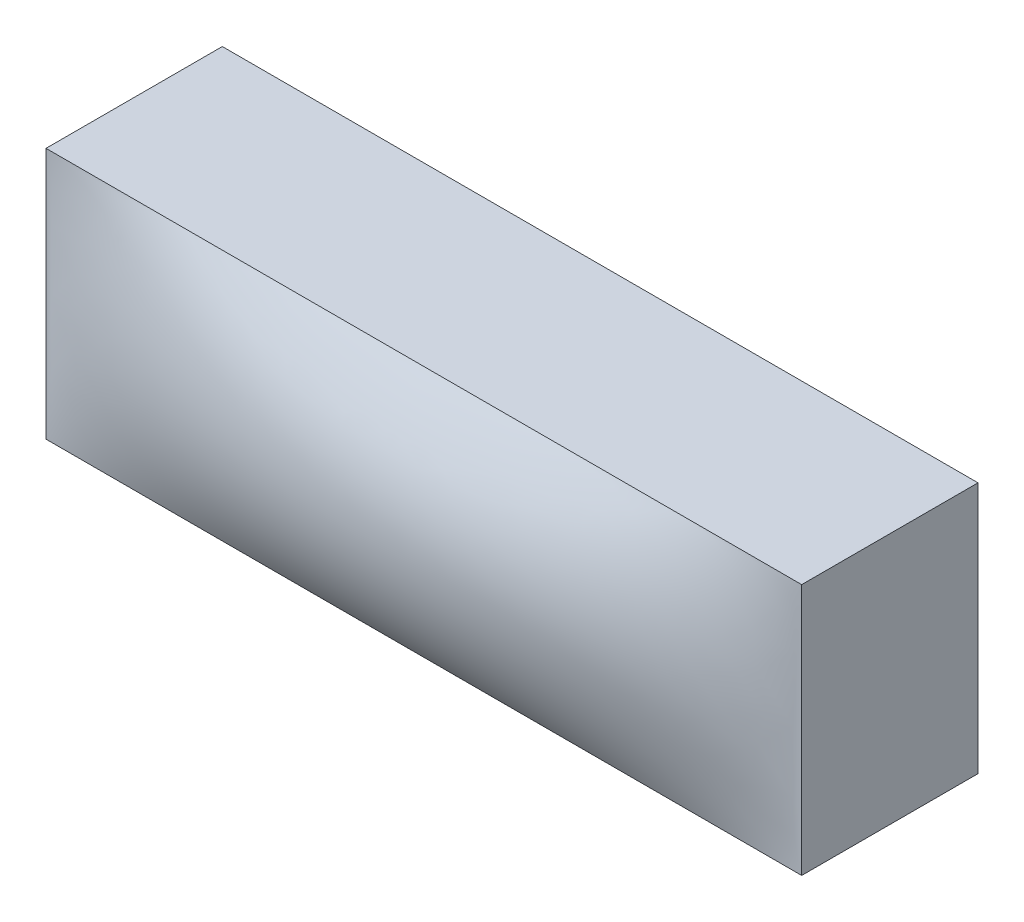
ISO-10303-21;
HEADER;
FILE_DESCRIPTION(('STEP AP214'),'2;1');
FILE_NAME('part.step','',(''),(''),'','','');
FILE_SCHEMA(('AUTOMOTIVE_DESIGN { 1 0 10303 214 1 1 1 1 }'));
ENDSEC;
DATA;
#1=APPLICATION_CONTEXT('core data for automotive mechanical design processes');
#2=APPLICATION_PROTOCOL_DEFINITION('international standard','automotive_design',2000,#1);
#3=PRODUCT_CONTEXT('',#1,'mechanical');
#4=PRODUCT('Part','Part','',(#3));
#5=PRODUCT_RELATED_PRODUCT_CATEGORY('part','',(#4));
#6=PRODUCT_DEFINITION_FORMATION('','',#4);
#7=PRODUCT_DEFINITION_CONTEXT('part definition',#1,'design');
#8=PRODUCT_DEFINITION('design','',#6,#7);
#9=PRODUCT_DEFINITION_SHAPE('','',#8);
#10=(LENGTH_UNIT() NAMED_UNIT(*) SI_UNIT(.MILLI.,.METRE.));
#11=(NAMED_UNIT(*) PLANE_ANGLE_UNIT() SI_UNIT($,.RADIAN.));
#12=(NAMED_UNIT(*) SI_UNIT($,.STERADIAN.) SOLID_ANGLE_UNIT());
#13=UNCERTAINTY_MEASURE_WITH_UNIT(LENGTH_MEASURE(1.E-05),#10,'distance_accuracy_value','');
#14=(GEOMETRIC_REPRESENTATION_CONTEXT(3) GLOBAL_UNCERTAINTY_ASSIGNED_CONTEXT((#13)) GLOBAL_UNIT_ASSIGNED_CONTEXT((#10,
#11,#12)) REPRESENTATION_CONTEXT('',''));
#15=CARTESIAN_POINT('',(0.,0.,0.));
#16=DIRECTION('',(0.,0.,1.));
#17=DIRECTION('',(1.,0.,0.));
#18=AXIS2_PLACEMENT_3D('',#15,#16,#17);
#19=CARTESIAN_POINT('',(0.,0.,7.));
#20=DIRECTION('',(1.,0.,0.));
#21=DIRECTION('',(0.,0.,-1.));
#22=AXIS2_PLACEMENT_3D('',#19,#20,#21);
#23=PLANE('',#22);
#24=DIRECTION('',(0.,-1.,0.));
#25=VECTOR('',#24,1.);
#26=CARTESIAN_POINT('',(0.,0.,0.));
#27=LINE('',#26,#25);
#28=CARTESIAN_POINT('',(0.,10.,0.));
#29=VERTEX_POINT('',#28);
#30=CARTESIAN_POINT('',(0.,0.,0.));
#31=VERTEX_POINT('',#30);
#32=EDGE_CURVE('E87',#29,#31,#27,.T.);
#33=ORIENTED_EDGE('',*,*,#32,.T.);
#34=DIRECTION('',(0.,0.,-1.));
#35=VECTOR('',#34,1.);
#36=CARTESIAN_POINT('',(0.,0.,7.));
#37=LINE('',#36,#35);
#38=CARTESIAN_POINT('',(0.,0.,7.));
#39=VERTEX_POINT('',#38);
#40=EDGE_CURVE('E11',#39,#31,#37,.T.);
#41=ORIENTED_EDGE('',*,*,#40,.F.);
#42=DIRECTION('',(0.,-1.,0.));
#43=VECTOR('',#42,1.);
#44=CARTESIAN_POINT('',(0.,0.,7.));
#45=LINE('',#44,#43);
#46=CARTESIAN_POINT('',(0.,10.,7.));
#47=VERTEX_POINT('',#46);
#48=EDGE_CURVE('E98',#47,#39,#45,.T.);
#49=ORIENTED_EDGE('',*,*,#48,.F.);
#50=DIRECTION('',(0.,0.,-1.));
#51=VECTOR('',#50,1.);
#52=CARTESIAN_POINT('',(0.,10.,7.));
#53=LINE('',#52,#51);
#54=EDGE_CURVE('E93',#47,#29,#53,.T.);
#55=ORIENTED_EDGE('',*,*,#54,.T.);
#56=EDGE_LOOP('',(#33,#41,#49,#55));
#57=FACE_BOUND('',#56,.T.);
#58=ADVANCED_FACE('F31',(#57),#23,.F.);
#59=CARTESIAN_POINT('',(0.,0.,7.));
#60=DIRECTION('',(0.,1.,0.));
#61=DIRECTION('',(0.,0.,1.));
#62=AXIS2_PLACEMENT_3D('',#59,#60,#61);
#63=PLANE('',#62);
#64=DIRECTION('',(1.,0.,0.));
#65=VECTOR('',#64,1.);
#66=CARTESIAN_POINT('',(0.,0.,0.));
#67=LINE('',#66,#65);
#68=CARTESIAN_POINT('',(30.,0.,0.));
#69=VERTEX_POINT('',#68);
#70=EDGE_CURVE('E84',#31,#69,#67,.T.);
#71=ORIENTED_EDGE('',*,*,#70,.T.);
#72=DIRECTION('',(0.,0.,-1.));
#73=VECTOR('',#72,1.);
#74=CARTESIAN_POINT('',(30.,0.,7.));
#75=LINE('',#74,#73);
#76=CARTESIAN_POINT('',(30.,0.,7.));
#77=VERTEX_POINT('',#76);
#78=EDGE_CURVE('E43',#77,#69,#75,.T.);
#79=ORIENTED_EDGE('',*,*,#78,.F.);
#80=DIRECTION('',(1.,0.,0.));
#81=VECTOR('',#80,1.);
#82=CARTESIAN_POINT('',(0.,0.,7.));
#83=LINE('',#82,#81);
#84=EDGE_CURVE('E37',#39,#77,#83,.T.);
#85=ORIENTED_EDGE('',*,*,#84,.F.);
#86=ORIENTED_EDGE('',*,*,#40,.T.);
#87=EDGE_LOOP('',(#71,#79,#85,#86));
#88=FACE_BOUND('',#87,.T.);
#89=ADVANCED_FACE('F90',(#88),#63,.F.);
#90=CARTESIAN_POINT('',(30.,0.,7.));
#91=DIRECTION('',(-1.,0.,0.));
#92=DIRECTION('',(0.,0.,1.));
#93=AXIS2_PLACEMENT_3D('',#90,#91,#92);
#94=PLANE('',#93);
#95=DIRECTION('',(0.,1.,0.));
#96=VECTOR('',#95,1.);
#97=CARTESIAN_POINT('',(30.,0.,0.));
#98=LINE('',#97,#96);
#99=CARTESIAN_POINT('',(30.,10.,0.));
#100=VERTEX_POINT('',#99);
#101=EDGE_CURVE('E76',#69,#100,#98,.T.);
#102=ORIENTED_EDGE('',*,*,#101,.T.);
#103=DIRECTION('',(0.,0.,-1.));
#104=VECTOR('',#103,1.);
#105=CARTESIAN_POINT('',(30.,10.,7.));
#106=LINE('',#105,#104);
#107=CARTESIAN_POINT('',(30.,10.,7.));
#108=VERTEX_POINT('',#107);
#109=EDGE_CURVE('E100',#108,#100,#106,.T.);
#110=ORIENTED_EDGE('',*,*,#109,.F.);
#111=DIRECTION('',(0.,1.,0.));
#112=VECTOR('',#111,1.);
#113=CARTESIAN_POINT('',(30.,0.,7.));
#114=LINE('',#113,#112);
#115=EDGE_CURVE('E104',#77,#108,#114,.T.);
#116=ORIENTED_EDGE('',*,*,#115,.F.);
#117=ORIENTED_EDGE('',*,*,#78,.T.);
#118=EDGE_LOOP('',(#102,#110,#116,#117));
#119=FACE_BOUND('',#118,.T.);
#120=ADVANCED_FACE('F106',(#119),#94,.F.);
#121=CARTESIAN_POINT('',(0.,10.,7.));
#122=DIRECTION('',(0.,-1.,0.));
#123=DIRECTION('',(0.,0.,-1.));
#124=AXIS2_PLACEMENT_3D('',#121,#122,#123);
#125=PLANE('',#124);
#126=DIRECTION('',(-1.,0.,0.));
#127=VECTOR('',#126,1.);
#128=CARTESIAN_POINT('',(0.,10.,0.));
#129=LINE('',#128,#127);
#130=EDGE_CURVE('E68',#100,#29,#129,.T.);
#131=ORIENTED_EDGE('',*,*,#130,.T.);
#132=ORIENTED_EDGE('',*,*,#54,.F.);
#133=DIRECTION('',(-1.,0.,0.));
#134=VECTOR('',#133,1.);
#135=CARTESIAN_POINT('',(0.,10.,7.));
#136=LINE('',#135,#134);
#137=EDGE_CURVE('E52',#108,#47,#136,.T.);
#138=ORIENTED_EDGE('',*,*,#137,.F.);
#139=ORIENTED_EDGE('',*,*,#109,.T.);
#140=EDGE_LOOP('',(#131,#132,#138,#139));
#141=FACE_BOUND('',#140,.T.);
#142=ADVANCED_FACE('F107',(#141),#125,.F.);
#143=CARTESIAN_POINT('',(0.,0.,7.));
#144=CARTESIAN_POINT('',(10.,0.,7.));
#145=CARTESIAN_POINT('',(20.,0.,7.));
#146=CARTESIAN_POINT('',(30.,0.,7.));
#147=CARTESIAN_POINT('',(0.,3.33333333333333,7.));
#148=CARTESIAN_POINT('',(10.,3.33333333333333,10.5555555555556));
#149=CARTESIAN_POINT('',(20.,3.33333333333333,10.5555555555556));
#150=CARTESIAN_POINT('',(30.,3.33333333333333,7.));
#151=CARTESIAN_POINT('',(0.,6.66666666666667,7.));
#152=CARTESIAN_POINT('',(10.,6.66666666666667,10.5555555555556));
#153=CARTESIAN_POINT('',(20.,6.66666666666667,10.5555555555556));
#154=CARTESIAN_POINT('',(30.,6.66666666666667,7.));
#155=CARTESIAN_POINT('',(0.,10.,7.));
#156=CARTESIAN_POINT('',(10.,10.,7.));
#157=CARTESIAN_POINT('',(20.,10.,7.));
#158=CARTESIAN_POINT('',(30.,10.,7.));
#159=B_SPLINE_SURFACE_WITH_KNOTS('',3,3,((#143,#144,#145,#146),(#147,#148,#149,#150),(#151,#152,
#153,#154),(#155,#156,#157,#158)),.UNSPECIFIED.,.F.,.F.,.F.,(4,4),(4,4),(0.,1.),(0.,1.),.UNSPECIFIED.);
#160=ORIENTED_EDGE('',*,*,#48,.T.);
#161=ORIENTED_EDGE('',*,*,#84,.T.);
#162=ORIENTED_EDGE('',*,*,#115,.T.);
#163=ORIENTED_EDGE('',*,*,#137,.T.);
#164=EDGE_LOOP('',(#160,#161,#162,#163));
#165=FACE_BOUND('',#164,.T.);
#166=ADVANCED_FACE('F33',(#165),#159,.F.);
#167=CARTESIAN_POINT('',(0.,10.,0.));
#168=DIRECTION('',(0.,0.,-1.));
#169=DIRECTION('',(-1.,0.,0.));
#170=AXIS2_PLACEMENT_3D('',#167,#168,#169);
#171=PLANE('',#170);
#172=ORIENTED_EDGE('',*,*,#32,.F.);
#173=ORIENTED_EDGE('',*,*,#130,.F.);
#174=ORIENTED_EDGE('',*,*,#101,.F.);
#175=ORIENTED_EDGE('',*,*,#70,.F.);
#176=EDGE_LOOP('',(#172,#173,#174,#175));
#177=FACE_BOUND('',#176,.T.);
#178=ADVANCED_FACE('F85',(#177),#171,.T.);
#179=CLOSED_SHELL('',(#58,#89,#120,#142,#166,#178));
#180=MANIFOLD_SOLID_BREP('B2',#179);
#181=ADVANCED_BREP_SHAPE_REPRESENTATION('',(#18,#180),#14);
#182=SHAPE_DEFINITION_REPRESENTATION(#9,#181);
ENDSEC;
END-ISO-10303-21;
